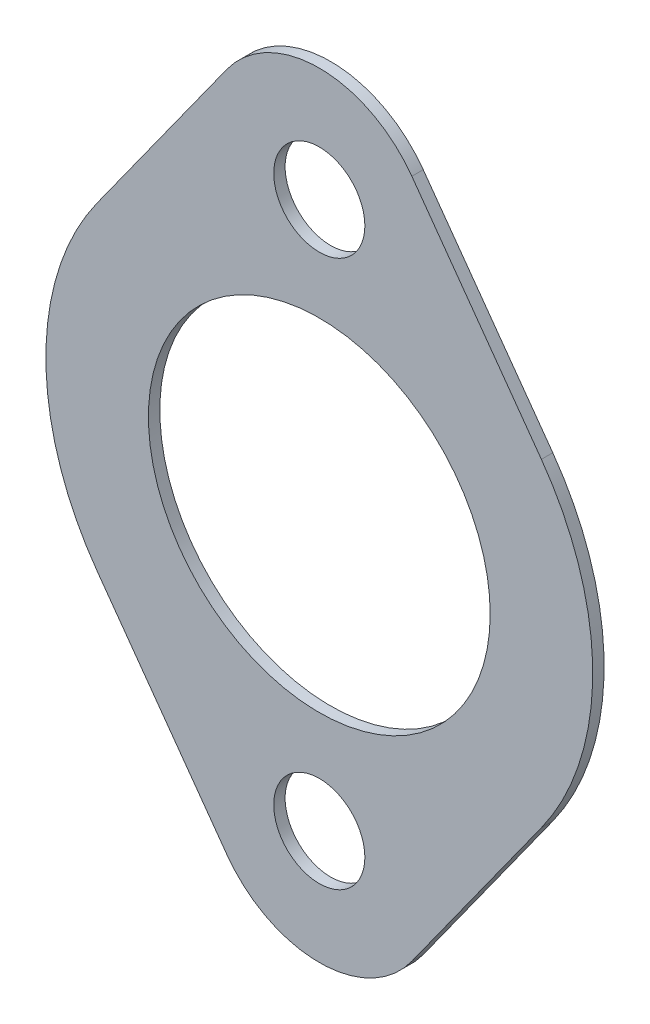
ISO-10303-21;
HEADER;
FILE_DESCRIPTION(('STEP AP214'),'2;1');
FILE_NAME('part.step','',(''),(''),'','','');
FILE_SCHEMA(('AUTOMOTIVE_DESIGN { 1 0 10303 214 1 1 1 1 }'));
ENDSEC;
DATA;
#1=APPLICATION_CONTEXT('core data for automotive mechanical design processes');
#2=APPLICATION_PROTOCOL_DEFINITION('international standard','automotive_design',2000,#1);
#3=PRODUCT_CONTEXT('',#1,'mechanical');
#4=PRODUCT('Part','Part','',(#3));
#5=PRODUCT_RELATED_PRODUCT_CATEGORY('part','',(#4));
#6=PRODUCT_DEFINITION_FORMATION('','',#4);
#7=PRODUCT_DEFINITION_CONTEXT('part definition',#1,'design');
#8=PRODUCT_DEFINITION('design','',#6,#7);
#9=PRODUCT_DEFINITION_SHAPE('','',#8);
#10=(LENGTH_UNIT() NAMED_UNIT(*) SI_UNIT(.MILLI.,.METRE.));
#11=(NAMED_UNIT(*) PLANE_ANGLE_UNIT() SI_UNIT($,.RADIAN.));
#12=(NAMED_UNIT(*) SI_UNIT($,.STERADIAN.) SOLID_ANGLE_UNIT());
#13=UNCERTAINTY_MEASURE_WITH_UNIT(LENGTH_MEASURE(1.E-05),#10,'distance_accuracy_value','');
#14=(GEOMETRIC_REPRESENTATION_CONTEXT(3) GLOBAL_UNCERTAINTY_ASSIGNED_CONTEXT((#13)) GLOBAL_UNIT_ASSIGNED_CONTEXT((#10,
#11,#12)) REPRESENTATION_CONTEXT('',''));
#15=CARTESIAN_POINT('',(0.,0.,0.));
#16=DIRECTION('',(0.,0.,1.));
#17=DIRECTION('',(1.,0.,0.));
#18=AXIS2_PLACEMENT_3D('',#15,#16,#17);
#19=CARTESIAN_POINT('',(0.,38.1,1.5875));
#20=DIRECTION('',(0.,0.,-1.));
#21=DIRECTION('',(-1.,0.,0.));
#22=AXIS2_PLACEMENT_3D('',#19,#20,#21);
#23=CYLINDRICAL_SURFACE('',#22,15.875);
#24=CARTESIAN_POINT('',(0.,38.1,0.));
#25=DIRECTION('',(0.,0.,-1.));
#26=DIRECTION('',(-1.,0.,0.));
#27=AXIS2_PLACEMENT_3D('',#24,#25,#26);
#28=CIRCLE('',#27,15.875);
#29=CARTESIAN_POINT('',(-12.8941966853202,47.3604166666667,0.));
#30=VERTEX_POINT('',#29);
#31=CARTESIAN_POINT('',(12.8941966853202,47.3604166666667,0.));
#32=VERTEX_POINT('',#31);
#33=EDGE_CURVE('E93',#30,#32,#28,.T.);
#34=ORIENTED_EDGE('',*,*,#33,.F.);
#35=DIRECTION('',(0.,0.,-1.));
#36=VECTOR('',#35,1.);
#37=CARTESIAN_POINT('',(-12.8941966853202,47.3604166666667,1.5875));
#38=LINE('',#37,#36);
#39=CARTESIAN_POINT('',(-12.8941966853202,47.3604166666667,1.5875));
#40=VERTEX_POINT('',#39);
#41=EDGE_CURVE('E11',#40,#30,#38,.T.);
#42=ORIENTED_EDGE('',*,*,#41,.F.);
#43=CARTESIAN_POINT('',(0.,38.1,1.5875));
#44=DIRECTION('',(0.,0.,-1.));
#45=DIRECTION('',(-1.,0.,0.));
#46=AXIS2_PLACEMENT_3D('',#43,#44,#45);
#47=CIRCLE('',#46,15.875);
#48=CARTESIAN_POINT('',(12.8941966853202,47.3604166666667,1.5875));
#49=VERTEX_POINT('',#48);
#50=EDGE_CURVE('E94',#40,#49,#47,.T.);
#51=ORIENTED_EDGE('',*,*,#50,.T.);
#52=DIRECTION('',(0.,0.,-1.));
#53=VECTOR('',#52,1.);
#54=CARTESIAN_POINT('',(12.8941966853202,47.3604166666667,1.5875));
#55=LINE('',#54,#53);
#56=EDGE_CURVE('E31',#49,#32,#55,.T.);
#57=ORIENTED_EDGE('',*,*,#56,.T.);
#58=EDGE_LOOP('',(#34,#42,#51,#57));
#59=FACE_BOUND('',#58,.T.);
#60=ADVANCED_FACE('F28',(#59),#23,.T.);
#61=CARTESIAN_POINT('',(-12.8941966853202,47.3604166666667,1.5875));
#62=DIRECTION('',(0.812232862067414,-0.583333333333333,0.));
#63=DIRECTION('',(0.583333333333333,0.812232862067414,0.));
#64=AXIS2_PLACEMENT_3D('',#61,#62,#63);
#65=PLANE('',#64);
#66=DIRECTION('',(-0.583333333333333,-0.812232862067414,0.));
#67=VECTOR('',#66,1.);
#68=CARTESIAN_POINT('',(-12.8941966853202,47.3604166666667,0.));
#69=LINE('',#68,#67);
#70=CARTESIAN_POINT('',(-30.9460720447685,22.225,0.));
#71=VERTEX_POINT('',#70);
#72=EDGE_CURVE('E111',#30,#71,#69,.T.);
#73=ORIENTED_EDGE('',*,*,#72,.T.);
#74=DIRECTION('',(0.,0.,-1.));
#75=VECTOR('',#74,1.);
#76=CARTESIAN_POINT('',(-30.9460720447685,22.225,1.5875));
#77=LINE('',#76,#75);
#78=CARTESIAN_POINT('',(-30.9460720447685,22.225,1.5875));
#79=VERTEX_POINT('',#78);
#80=EDGE_CURVE('E36',#79,#71,#77,.T.);
#81=ORIENTED_EDGE('',*,*,#80,.F.);
#82=DIRECTION('',(-0.583333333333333,-0.812232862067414,0.));
#83=VECTOR('',#82,1.);
#84=CARTESIAN_POINT('',(-12.8941966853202,47.3604166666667,1.5875));
#85=LINE('',#84,#83);
#86=EDGE_CURVE('E49',#40,#79,#85,.T.);
#87=ORIENTED_EDGE('',*,*,#86,.F.);
#88=ORIENTED_EDGE('',*,*,#41,.T.);
#89=EDGE_LOOP('',(#73,#81,#87,#88));
#90=FACE_BOUND('',#89,.T.);
#91=ADVANCED_FACE('F177',(#90),#65,.F.);
#92=CARTESIAN_POINT('',(0.,0.,1.5875));
#93=DIRECTION('',(0.,0.,-1.));
#94=DIRECTION('',(-1.,0.,0.));
#95=AXIS2_PLACEMENT_3D('',#92,#93,#94);
#96=CYLINDRICAL_SURFACE('',#95,38.1);
#97=CARTESIAN_POINT('',(0.,0.,0.));
#98=DIRECTION('',(0.,0.,-1.));
#99=DIRECTION('',(-1.,0.,0.));
#100=AXIS2_PLACEMENT_3D('',#97,#98,#99);
#101=CIRCLE('',#100,38.1);
#102=CARTESIAN_POINT('',(-30.9460720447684,-22.225,0.));
#103=VERTEX_POINT('',#102);
#104=EDGE_CURVE('E128',#103,#71,#101,.T.);
#105=ORIENTED_EDGE('',*,*,#104,.F.);
#106=DIRECTION('',(0.,0.,-1.));
#107=VECTOR('',#106,1.);
#108=CARTESIAN_POINT('',(-30.9460720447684,-22.225,1.5875));
#109=LINE('',#108,#107);
#110=CARTESIAN_POINT('',(-30.9460720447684,-22.225,1.5875));
#111=VERTEX_POINT('',#110);
#112=EDGE_CURVE('E149',#111,#103,#109,.T.);
#113=ORIENTED_EDGE('',*,*,#112,.F.);
#114=CARTESIAN_POINT('',(0.,0.,1.5875));
#115=DIRECTION('',(0.,0.,-1.));
#116=DIRECTION('',(-1.,0.,0.));
#117=AXIS2_PLACEMENT_3D('',#114,#115,#116);
#118=CIRCLE('',#117,38.1);
#119=EDGE_CURVE('E144',#111,#79,#118,.T.);
#120=ORIENTED_EDGE('',*,*,#119,.T.);
#121=ORIENTED_EDGE('',*,*,#80,.T.);
#122=EDGE_LOOP('',(#105,#113,#120,#121));
#123=FACE_BOUND('',#122,.T.);
#124=ADVANCED_FACE('F175',(#123),#96,.T.);
#125=CARTESIAN_POINT('',(-12.8941966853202,-47.3604166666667,1.5875));
#126=DIRECTION('',(-0.812232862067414,-0.583333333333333,0.));
#127=DIRECTION('',(0.583333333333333,-0.812232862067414,0.));
#128=AXIS2_PLACEMENT_3D('',#125,#126,#127);
#129=PLANE('',#128);
#130=DIRECTION('',(-0.583333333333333,0.812232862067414,0.));
#131=VECTOR('',#130,1.);
#132=CARTESIAN_POINT('',(-12.8941966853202,-47.3604166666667,0.));
#133=LINE('',#132,#131);
#134=CARTESIAN_POINT('',(-12.8941966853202,-47.3604166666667,0.));
#135=VERTEX_POINT('',#134);
#136=EDGE_CURVE('E125',#135,#103,#133,.T.);
#137=ORIENTED_EDGE('',*,*,#136,.F.);
#138=DIRECTION('',(0.,0.,-1.));
#139=VECTOR('',#138,1.);
#140=CARTESIAN_POINT('',(-12.8941966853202,-47.3604166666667,1.5875));
#141=LINE('',#140,#139);
#142=CARTESIAN_POINT('',(-12.8941966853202,-47.3604166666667,1.5875));
#143=VERTEX_POINT('',#142);
#144=EDGE_CURVE('E151',#143,#135,#141,.T.);
#145=ORIENTED_EDGE('',*,*,#144,.F.);
#146=DIRECTION('',(-0.583333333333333,0.812232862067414,0.));
#147=VECTOR('',#146,1.);
#148=CARTESIAN_POINT('',(-12.8941966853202,-47.3604166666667,1.5875));
#149=LINE('',#148,#147);
#150=EDGE_CURVE('E141',#143,#111,#149,.T.);
#151=ORIENTED_EDGE('',*,*,#150,.T.);
#152=ORIENTED_EDGE('',*,*,#112,.T.);
#153=EDGE_LOOP('',(#137,#145,#151,#152));
#154=FACE_BOUND('',#153,.T.);
#155=ADVANCED_FACE('F170',(#154),#129,.T.);
#156=CARTESIAN_POINT('',(0.,-38.1,1.5875));
#157=DIRECTION('',(0.,0.,-1.));
#158=DIRECTION('',(-1.,0.,0.));
#159=AXIS2_PLACEMENT_3D('',#156,#157,#158);
#160=CYLINDRICAL_SURFACE('',#159,15.875);
#161=CARTESIAN_POINT('',(0.,-38.1,0.));
#162=DIRECTION('',(0.,0.,1.));
#163=DIRECTION('',(1.,0.,0.));
#164=AXIS2_PLACEMENT_3D('',#161,#162,#163);
#165=CIRCLE('',#164,15.875);
#166=CARTESIAN_POINT('',(12.8941966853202,-47.3604166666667,0.));
#167=VERTEX_POINT('',#166);
#168=EDGE_CURVE('E123',#135,#167,#165,.T.);
#169=ORIENTED_EDGE('',*,*,#168,.T.);
#170=DIRECTION('',(0.,0.,-1.));
#171=VECTOR('',#170,1.);
#172=CARTESIAN_POINT('',(12.8941966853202,-47.3604166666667,1.5875));
#173=LINE('',#172,#171);
#174=CARTESIAN_POINT('',(12.8941966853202,-47.3604166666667,1.5875));
#175=VERTEX_POINT('',#174);
#176=EDGE_CURVE('E153',#175,#167,#173,.T.);
#177=ORIENTED_EDGE('',*,*,#176,.F.);
#178=CARTESIAN_POINT('',(0.,-38.1,1.5875));
#179=DIRECTION('',(0.,0.,1.));
#180=DIRECTION('',(1.,0.,0.));
#181=AXIS2_PLACEMENT_3D('',#178,#179,#180);
#182=CIRCLE('',#181,15.875);
#183=EDGE_CURVE('E139',#143,#175,#182,.T.);
#184=ORIENTED_EDGE('',*,*,#183,.F.);
#185=ORIENTED_EDGE('',*,*,#144,.T.);
#186=EDGE_LOOP('',(#169,#177,#184,#185));
#187=FACE_BOUND('',#186,.T.);
#188=ADVANCED_FACE('F179',(#187),#160,.T.);
#189=CARTESIAN_POINT('',(12.8941966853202,-47.3604166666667,1.5875));
#190=DIRECTION('',(-0.812232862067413,0.583333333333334,0.));
#191=DIRECTION('',(-0.583333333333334,-0.812232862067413,0.));
#192=AXIS2_PLACEMENT_3D('',#189,#190,#191);
#193=PLANE('',#192);
#194=DIRECTION('',(0.583333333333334,0.812232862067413,0.));
#195=VECTOR('',#194,1.);
#196=CARTESIAN_POINT('',(12.8941966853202,-47.3604166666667,0.));
#197=LINE('',#196,#195);
#198=CARTESIAN_POINT('',(30.9460720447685,-22.225,0.));
#199=VERTEX_POINT('',#198);
#200=EDGE_CURVE('E120',#167,#199,#197,.T.);
#201=ORIENTED_EDGE('',*,*,#200,.T.);
#202=DIRECTION('',(0.,0.,-1.));
#203=VECTOR('',#202,1.);
#204=CARTESIAN_POINT('',(30.9460720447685,-22.225,1.5875));
#205=LINE('',#204,#203);
#206=CARTESIAN_POINT('',(30.9460720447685,-22.225,1.5875));
#207=VERTEX_POINT('',#206);
#208=EDGE_CURVE('E156',#207,#199,#205,.T.);
#209=ORIENTED_EDGE('',*,*,#208,.F.);
#210=DIRECTION('',(0.583333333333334,0.812232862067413,0.));
#211=VECTOR('',#210,1.);
#212=CARTESIAN_POINT('',(12.8941966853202,-47.3604166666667,1.5875));
#213=LINE('',#212,#211);
#214=EDGE_CURVE('E137',#175,#207,#213,.T.);
#215=ORIENTED_EDGE('',*,*,#214,.F.);
#216=ORIENTED_EDGE('',*,*,#176,.T.);
#217=EDGE_LOOP('',(#201,#209,#215,#216));
#218=FACE_BOUND('',#217,.T.);
#219=ADVANCED_FACE('F164',(#218),#193,.F.);
#220=CARTESIAN_POINT('',(0.,0.,1.5875));
#221=DIRECTION('',(0.,0.,-1.));
#222=DIRECTION('',(-1.,0.,0.));
#223=AXIS2_PLACEMENT_3D('',#220,#221,#222);
#224=CYLINDRICAL_SURFACE('',#223,38.1);
#225=CARTESIAN_POINT('',(0.,0.,0.));
#226=DIRECTION('',(0.,0.,-1.));
#227=DIRECTION('',(-1.,0.,0.));
#228=AXIS2_PLACEMENT_3D('',#225,#226,#227);
#229=CIRCLE('',#228,38.1);
#230=CARTESIAN_POINT('',(30.9460720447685,22.225,0.));
#231=VERTEX_POINT('',#230);
#232=EDGE_CURVE('E105',#231,#199,#229,.T.);
#233=ORIENTED_EDGE('',*,*,#232,.F.);
#234=DIRECTION('',(0.,0.,-1.));
#235=VECTOR('',#234,1.);
#236=CARTESIAN_POINT('',(30.9460720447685,22.225,1.5875));
#237=LINE('',#236,#235);
#238=CARTESIAN_POINT('',(30.9460720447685,22.225,1.5875));
#239=VERTEX_POINT('',#238);
#240=EDGE_CURVE('E98',#239,#231,#237,.T.);
#241=ORIENTED_EDGE('',*,*,#240,.F.);
#242=CARTESIAN_POINT('',(0.,0.,1.5875));
#243=DIRECTION('',(0.,0.,-1.));
#244=DIRECTION('',(-1.,0.,0.));
#245=AXIS2_PLACEMENT_3D('',#242,#243,#244);
#246=CIRCLE('',#245,38.1);
#247=EDGE_CURVE('E134',#239,#207,#246,.T.);
#248=ORIENTED_EDGE('',*,*,#247,.T.);
#249=ORIENTED_EDGE('',*,*,#208,.T.);
#250=EDGE_LOOP('',(#233,#241,#248,#249));
#251=FACE_BOUND('',#250,.T.);
#252=ADVANCED_FACE('F159',(#251),#224,.T.);
#253=CARTESIAN_POINT('',(12.8941966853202,47.3604166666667,1.5875));
#254=DIRECTION('',(0.812232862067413,0.583333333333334,0.));
#255=DIRECTION('',(-0.583333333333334,0.812232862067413,0.));
#256=AXIS2_PLACEMENT_3D('',#253,#254,#255);
#257=PLANE('',#256);
#258=DIRECTION('',(0.583333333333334,-0.812232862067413,0.));
#259=VECTOR('',#258,1.);
#260=CARTESIAN_POINT('',(12.8941966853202,47.3604166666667,0.));
#261=LINE('',#260,#259);
#262=EDGE_CURVE('E100',#32,#231,#261,.T.);
#263=ORIENTED_EDGE('',*,*,#262,.F.);
#264=ORIENTED_EDGE('',*,*,#56,.F.);
#265=DIRECTION('',(0.583333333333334,-0.812232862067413,0.));
#266=VECTOR('',#265,1.);
#267=CARTESIAN_POINT('',(12.8941966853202,47.3604166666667,1.5875));
#268=LINE('',#267,#266);
#269=EDGE_CURVE('E132',#49,#239,#268,.T.);
#270=ORIENTED_EDGE('',*,*,#269,.T.);
#271=ORIENTED_EDGE('',*,*,#240,.T.);
#272=EDGE_LOOP('',(#263,#264,#270,#271));
#273=FACE_BOUND('',#272,.T.);
#274=ADVANCED_FACE('F101',(#273),#257,.T.);
#275=CARTESIAN_POINT('',(0.,38.1,1.5875));
#276=DIRECTION('',(0.,0.,-1.));
#277=DIRECTION('',(-1.,0.,0.));
#278=AXIS2_PLACEMENT_3D('',#275,#276,#277);
#279=PLANE('',#278);
#280=CARTESIAN_POINT('',(0.,0.,1.5875));
#281=DIRECTION('',(0.,0.,1.));
#282=DIRECTION('',(1.,0.,0.));
#283=AXIS2_PLACEMENT_3D('',#280,#281,#282);
#284=CIRCLE('',#283,23.8125);
#285=CARTESIAN_POINT('',(23.8125,0.,1.5875));
#286=VERTEX_POINT('',#285);
#287=EDGE_CURVE('E223',#286,#286,#284,.T.);
#288=ORIENTED_EDGE('',*,*,#287,.F.);
#289=EDGE_LOOP('',(#288));
#290=FACE_BOUND('',#289,.T.);
#291=CARTESIAN_POINT('',(0.,-38.1,1.5875));
#292=DIRECTION('',(0.,0.,1.));
#293=DIRECTION('',(1.,0.,0.));
#294=AXIS2_PLACEMENT_3D('',#291,#292,#293);
#295=CIRCLE('',#294,6.35);
#296=CARTESIAN_POINT('',(6.35,-38.1,1.5875));
#297=VERTEX_POINT('',#296);
#298=EDGE_CURVE('E225',#297,#297,#295,.T.);
#299=ORIENTED_EDGE('',*,*,#298,.F.);
#300=EDGE_LOOP('',(#299));
#301=FACE_BOUND('',#300,.T.);
#302=CARTESIAN_POINT('',(0.,38.1,1.5875));
#303=DIRECTION('',(0.,0.,1.));
#304=DIRECTION('',(1.,0.,0.));
#305=AXIS2_PLACEMENT_3D('',#302,#303,#304);
#306=CIRCLE('',#305,6.35);
#307=CARTESIAN_POINT('',(6.35,38.1,1.5875));
#308=VERTEX_POINT('',#307);
#309=EDGE_CURVE('E115',#308,#308,#306,.T.);
#310=ORIENTED_EDGE('',*,*,#309,.F.);
#311=EDGE_LOOP('',(#310));
#312=FACE_BOUND('',#311,.T.);
#313=ORIENTED_EDGE('',*,*,#50,.F.);
#314=ORIENTED_EDGE('',*,*,#86,.T.);
#315=ORIENTED_EDGE('',*,*,#119,.F.);
#316=ORIENTED_EDGE('',*,*,#150,.F.);
#317=ORIENTED_EDGE('',*,*,#183,.T.);
#318=ORIENTED_EDGE('',*,*,#214,.T.);
#319=ORIENTED_EDGE('',*,*,#247,.F.);
#320=ORIENTED_EDGE('',*,*,#269,.F.);
#321=EDGE_LOOP('',(#313,#314,#315,#316,#317,#318,#319,#320));
#322=FACE_BOUND('',#321,.T.);
#323=ADVANCED_FACE('F178',(#290,#301,#312,#322),#279,.F.);
#324=CARTESIAN_POINT('',(0.,38.1,0.));
#325=DIRECTION('',(0.,0.,-1.));
#326=DIRECTION('',(-1.,0.,0.));
#327=AXIS2_PLACEMENT_3D('',#324,#325,#326);
#328=PLANE('',#327);
#329=CARTESIAN_POINT('',(0.,0.,0.));
#330=DIRECTION('',(0.,0.,1.));
#331=DIRECTION('',(1.,0.,0.));
#332=AXIS2_PLACEMENT_3D('',#329,#330,#331);
#333=CIRCLE('',#332,23.8125);
#334=CARTESIAN_POINT('',(23.8125,0.,0.));
#335=VERTEX_POINT('',#334);
#336=EDGE_CURVE('E220',#335,#335,#333,.T.);
#337=ORIENTED_EDGE('',*,*,#336,.T.);
#338=EDGE_LOOP('',(#337));
#339=FACE_BOUND('',#338,.T.);
#340=CARTESIAN_POINT('',(0.,-38.1,0.));
#341=DIRECTION('',(0.,0.,1.));
#342=DIRECTION('',(1.,0.,0.));
#343=AXIS2_PLACEMENT_3D('',#340,#341,#342);
#344=CIRCLE('',#343,6.35);
#345=CARTESIAN_POINT('',(6.35,-38.1,0.));
#346=VERTEX_POINT('',#345);
#347=EDGE_CURVE('E230',#346,#346,#344,.T.);
#348=ORIENTED_EDGE('',*,*,#347,.T.);
#349=EDGE_LOOP('',(#348));
#350=FACE_BOUND('',#349,.T.);
#351=CARTESIAN_POINT('',(0.,38.1,0.));
#352=DIRECTION('',(0.,0.,1.));
#353=DIRECTION('',(1.,0.,0.));
#354=AXIS2_PLACEMENT_3D('',#351,#352,#353);
#355=CIRCLE('',#354,6.35);
#356=CARTESIAN_POINT('',(6.35,38.1,0.));
#357=VERTEX_POINT('',#356);
#358=EDGE_CURVE('E112',#357,#357,#355,.T.);
#359=ORIENTED_EDGE('',*,*,#358,.T.);
#360=EDGE_LOOP('',(#359));
#361=FACE_BOUND('',#360,.T.);
#362=ORIENTED_EDGE('',*,*,#33,.T.);
#363=ORIENTED_EDGE('',*,*,#262,.T.);
#364=ORIENTED_EDGE('',*,*,#232,.T.);
#365=ORIENTED_EDGE('',*,*,#200,.F.);
#366=ORIENTED_EDGE('',*,*,#168,.F.);
#367=ORIENTED_EDGE('',*,*,#136,.T.);
#368=ORIENTED_EDGE('',*,*,#104,.T.);
#369=ORIENTED_EDGE('',*,*,#72,.F.);
#370=EDGE_LOOP('',(#362,#363,#364,#365,#366,#367,#368,#369));
#371=FACE_BOUND('',#370,.T.);
#372=ADVANCED_FACE('F108',(#339,#350,#361,#371),#328,.T.);
#373=CARTESIAN_POINT('',(0.,38.1,0.));
#374=DIRECTION('',(0.,0.,1.));
#375=DIRECTION('',(1.,0.,0.));
#376=AXIS2_PLACEMENT_3D('',#373,#374,#375);
#377=CYLINDRICAL_SURFACE('',#376,6.35);
#378=ORIENTED_EDGE('',*,*,#358,.F.);
#379=EDGE_LOOP('',(#378));
#380=FACE_BOUND('',#379,.T.);
#381=ORIENTED_EDGE('',*,*,#309,.T.);
#382=EDGE_LOOP('',(#381));
#383=FACE_BOUND('',#382,.T.);
#384=ADVANCED_FACE('F203',(#380,#383),#377,.F.);
#385=CARTESIAN_POINT('',(0.,-38.1,0.));
#386=DIRECTION('',(0.,0.,1.));
#387=DIRECTION('',(1.,0.,0.));
#388=AXIS2_PLACEMENT_3D('',#385,#386,#387);
#389=CYLINDRICAL_SURFACE('',#388,6.35);
#390=ORIENTED_EDGE('',*,*,#347,.F.);
#391=EDGE_LOOP('',(#390));
#392=FACE_BOUND('',#391,.T.);
#393=ORIENTED_EDGE('',*,*,#298,.T.);
#394=EDGE_LOOP('',(#393));
#395=FACE_BOUND('',#394,.T.);
#396=ADVANCED_FACE('F207',(#392,#395),#389,.F.);
#397=CARTESIAN_POINT('',(0.,0.,0.));
#398=DIRECTION('',(0.,0.,1.));
#399=DIRECTION('',(1.,0.,0.));
#400=AXIS2_PLACEMENT_3D('',#397,#398,#399);
#401=CYLINDRICAL_SURFACE('',#400,23.8125);
#402=ORIENTED_EDGE('',*,*,#336,.F.);
#403=EDGE_LOOP('',(#402));
#404=FACE_BOUND('',#403,.T.);
#405=ORIENTED_EDGE('',*,*,#287,.T.);
#406=EDGE_LOOP('',(#405));
#407=FACE_BOUND('',#406,.T.);
#408=ADVANCED_FACE('F211',(#404,#407),#401,.F.);
#409=CLOSED_SHELL('',(#60,#91,#124,#155,#188,#219,#252,#274,#323,#372,#384,#396,#408));
#410=MANIFOLD_SOLID_BREP('B2',#409);
#411=ADVANCED_BREP_SHAPE_REPRESENTATION('',(#18,#410),#14);
#412=SHAPE_DEFINITION_REPRESENTATION(#9,#411);
ENDSEC;
END-ISO-10303-21;
